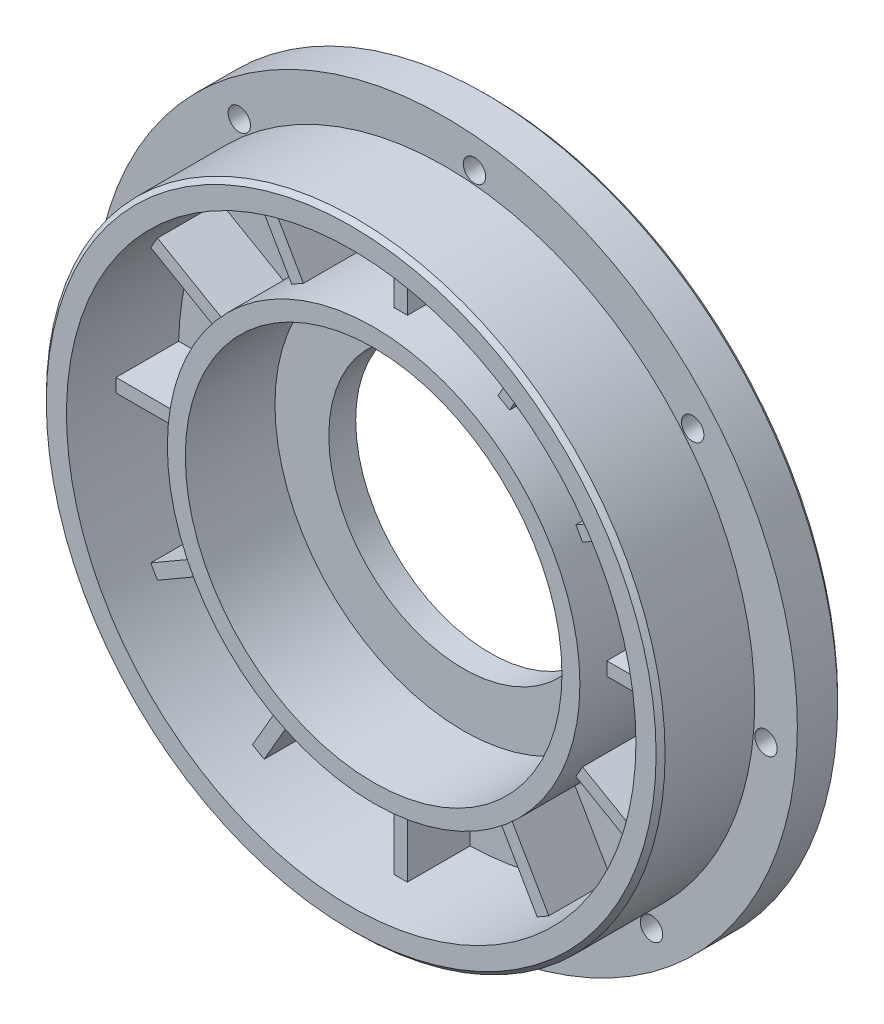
from build123d import *

# Parameters (mm, degrees)
ESQUISSE1_R                   = 39.25
ESQUISSE1_R_2                 = 15
FLASQUE_DEPTH                 = 5
ESQUISSE2_R                   = 34.5
ESQUISSE2_R_2                 = 31.75
CENTRAGE_DEPTH                = 10.5
CHANFREIN1_SIZE               = 0.5
R_DUCTION_START               = -2
ESQUISSE4_R                   = 31.75
R_DUCTION_D_PAISSEUR_DEPTH    = 2
LOGEMENT_ROULEMENT_DEPTH      = 8
LOGEMENT_ROULEMENT_DEPTH_BACK = 2
ESQUISSE3_R                   = 23
ESQUISSE3_R_2                 = 21
NERVURE1_REACH                = 59.631
ESQUISSE6_WALL_W              = 128.022488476
ESQUISSE6_WALL_H              = 1.5
R_P_TITION_CIRCULAIRE1_COUNT  = 12
R_P_TITION_CIRCULAIRE2_COUNT  = 8
ESQUISSE9_R                   = 19.5
ENL_V_MAT_EXTRU_2_DEPTH       = 0.5
BOSS_EXTRU_4_DEPTH            = 0.5


with BuildPart() as part:
    # Esquisse1 → flasque (new body)
    with BuildSketch(Plane.XY):
        Circle(ESQUISSE1_R)
        Circle(ESQUISSE1_R_2, mode=Mode.SUBTRACT)
    extrude(amount=FLASQUE_DEPTH)

    # Esquisse2 → centrage (add)
    with BuildSketch(Plane.XY.offset(5)):
        with Locations(Location((0, 0, 0), (0, 0, 180))):
            Circle(ESQUISSE2_R)
        with Locations(Location((0, 0, 0), (0, 0, 178.646430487))):
            Circle(ESQUISSE2_R_2, mode=Mode.SUBTRACT)
    extrude(amount=CENTRAGE_DEPTH)

    # Chanfrein1
    chanfrein1_edges = [part.edges().sort_by_distance(p)[0] for p in [
        (-39.25, 0, 0),
        (34.5, 0, 15.5),
    ]]
    chamfer(chanfrein1_edges, length=CHANFREIN1_SIZE)

    # Esquisse4 → r_duction d_paisseur (cut)
    with BuildSketch(Plane.XY.offset(5).offset(R_DUCTION_START)):
        with Locations(Location((0, 0, 0), (0, 0, 178.646430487))):
            Circle(ESQUISSE4_R)
    extrude(amount=R_DUCTION_D_PAISSEUR_DEPTH, mode=Mode.SUBTRACT)

    # Esquisse3 → logement roulement (add, two sides: drawn at the far end of the back side and taken through both)
    with BuildSketch(Plane.XY.offset(5).offset(-LOGEMENT_ROULEMENT_DEPTH_BACK)):
        Circle(ESQUISSE3_R)
        Circle(ESQUISSE3_R_2, mode=Mode.SUBTRACT)
    extrude(amount=LOGEMENT_ROULEMENT_DEPTH + LOGEMENT_ROULEMENT_DEPTH_BACK)

    # Esquisse6 wall → Nervure1 (add, up to next)
    with BuildSketch(Plane(origin=(0, 27.7114191, 9.983154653), x_dir=(0, -1, 0), z_dir=(0, 0, -1)), mode=Mode.PRIVATE) as nervure1_sk1:
        Rectangle(ESQUISSE6_WALL_W, ESQUISSE6_WALL_H)
    nervure1_tool1 = extrude(nervure1_sk1.sketch, amount=NERVURE1_REACH, mode=Mode.PRIVATE) - part.part
    nervure1 = nervure1_tool1.solids().sort_by_distance((0, 27.7114191, 9.983154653))[0]
    add(nervure1)

    # R_p_tition circulaire1: Nervure1 ×12 about axis
    r_p_tition_circulaire1_axis = Axis((0, 0, -5.529347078), (0, 0, 1))
    for i in range(1, R_P_TITION_CIRCULAIRE1_COUNT):
        add(nervure1.rotate(r_p_tition_circulaire1_axis, i * 360 / R_P_TITION_CIRCULAIRE1_COUNT))

    # Esquisse7 → Per_age1 (revolve, cut)
    with BuildSketch(Plane(origin=(3.248224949, 35.75, 0), x_dir=(0, 1, 0), z_dir=(1, 0, 0))):
        Polygon((0, 0), (0, 10.721687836), (1.25, 10), (1.25, 2.510362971), (3, 1.5), (3, 0), align=None)
    per_age1 = revolve(axis=Axis((3.248224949, 35.75, -6.130023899), (0, 0, 1)), mode=Mode.SUBTRACT)

    # R_p_tition circulaire2: Per_age1 ×8 about axis
    r_p_tition_circulaire2_axis = Axis((0, 0, -5.529347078), (0, 0, 1))
    for i in range(1, R_P_TITION_CIRCULAIRE2_COUNT):
        add(per_age1.rotate(r_p_tition_circulaire2_axis, i * 360 / R_P_TITION_CIRCULAIRE2_COUNT), mode=Mode.SUBTRACT)

    # Esquisse9 → Enl_v. mat.-Extru.2 (cut)
    with BuildSketch(Plane(origin=(0, 0, 0), x_dir=(-1, 0, 0), z_dir=(0, 0, -1))):
        with BuildLine():
            Line((-17.793224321, 16.105935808), (-22.982914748, 20.803500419))
            ThreePointArc((-22.982914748, 20.803500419), (-4.233701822, 30.709538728), (16.496507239, 26.246242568))
            Line((16.496507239, 26.246242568), (12.771489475, 20.319671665))
            ThreePointArc((12.771489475, 20.319671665), (3.277704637, -23.775126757), (-17.793224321, 16.105935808))
        make_face()
        Circle(ESQUISSE9_R, mode=Mode.SUBTRACT)
    extrude(amount=-ENL_V_MAT_EXTRU_2_DEPTH, mode=Mode.SUBTRACT)

    # Esquisse10 → Boss.-Extru.4 (add)
    with BuildSketch(Plane(origin=(0, 0, 0.5), x_dir=(-1, 0, 0), z_dir=(0, 0, -1))):
        with BuildLine():
            Line((-20.849888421, 21.570399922), (-17.504902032, 18.542610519))
            ThreePointArc((-17.504902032, 18.542610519), (-13.316764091, 21.746581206), (-8.559175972, 24.020626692))
            Line((-8.559175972, 24.020626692), (-8.791239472, 28.682993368))
            ThreePointArc((-8.791239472, 28.682993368), (-15.241271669, 25.839962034), (-20.849888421, 21.570399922))
        make_face()
        with BuildLine():
            Line((-16.761132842, 17.869371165), (-13.783714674, 15.174294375))
            ThreePointArc((-13.783714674, 15.174294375), (-11.183691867, 17.180658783), (-8.296642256, 18.746085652))
            Line((-8.296642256, 18.746085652), (-8.507161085, 22.975600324))
            ThreePointArc((-8.507161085, 22.975600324), (-12.889533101, 20.835305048), (-16.761132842, 17.869371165))
        make_face()
    extrude(amount=BOSS_EXTRU_4_DEPTH)


solid = part.part
